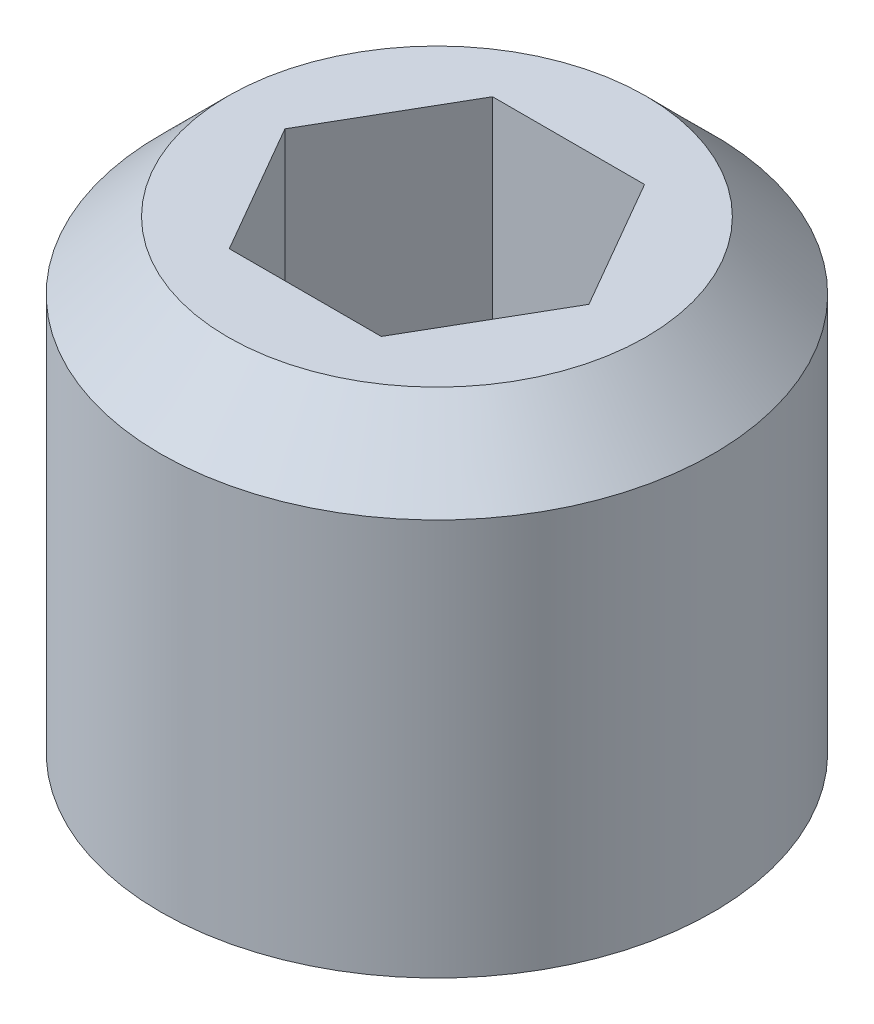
ISO-10303-21;
HEADER;
FILE_DESCRIPTION(('STEP AP214'),'2;1');
FILE_NAME('part.step','',(''),(''),'','','');
FILE_SCHEMA(('AUTOMOTIVE_DESIGN { 1 0 10303 214 1 1 1 1 }'));
ENDSEC;
DATA;
#1=APPLICATION_CONTEXT('core data for automotive mechanical design processes');
#2=APPLICATION_PROTOCOL_DEFINITION('international standard','automotive_design',2000,#1);
#3=PRODUCT_CONTEXT('',#1,'mechanical');
#4=PRODUCT('Part','Part','',(#3));
#5=PRODUCT_RELATED_PRODUCT_CATEGORY('part','',(#4));
#6=PRODUCT_DEFINITION_FORMATION('','',#4);
#7=PRODUCT_DEFINITION_CONTEXT('part definition',#1,'design');
#8=PRODUCT_DEFINITION('design','',#6,#7);
#9=PRODUCT_DEFINITION_SHAPE('','',#8);
#10=(LENGTH_UNIT() NAMED_UNIT(*) SI_UNIT(.MILLI.,.METRE.));
#11=(NAMED_UNIT(*) PLANE_ANGLE_UNIT() SI_UNIT($,.RADIAN.));
#12=(NAMED_UNIT(*) SI_UNIT($,.STERADIAN.) SOLID_ANGLE_UNIT());
#13=UNCERTAINTY_MEASURE_WITH_UNIT(LENGTH_MEASURE(1.E-05),#10,'distance_accuracy_value','');
#14=(GEOMETRIC_REPRESENTATION_CONTEXT(3) GLOBAL_UNCERTAINTY_ASSIGNED_CONTEXT((#13)) GLOBAL_UNIT_ASSIGNED_CONTEXT((#10,
#11,#12)) REPRESENTATION_CONTEXT('',''));
#15=CARTESIAN_POINT('',(0.,0.,0.));
#16=DIRECTION('',(0.,0.,1.));
#17=DIRECTION('',(1.,0.,0.));
#18=AXIS2_PLACEMENT_3D('',#15,#16,#17);
#19=CARTESIAN_POINT('',(0.,0.,0.));
#20=DIRECTION('',(0.,-1.,0.));
#21=DIRECTION('',(0.,0.,-1.));
#22=AXIS2_PLACEMENT_3D('',#19,#20,#21);
#23=PLANE('',#22);
#24=DIRECTION('',(-0.5,0.,-0.866025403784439));
#25=VECTOR('',#24,1.);
#26=CARTESIAN_POINT('',(1.14567944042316,0.,0.));
#27=LINE('',#26,#25);
#28=CARTESIAN_POINT('',(1.14567944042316,0.,0.));
#29=VERTEX_POINT('',#28);
#30=CARTESIAN_POINT('',(0.572839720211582,0.,-0.9921875));
#31=VERTEX_POINT('',#30);
#32=EDGE_CURVE('E98',#29,#31,#27,.T.);
#33=ORIENTED_EDGE('',*,*,#32,.F.);
#34=DIRECTION('',(0.5,0.,-0.866025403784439));
#35=VECTOR('',#34,1.);
#36=CARTESIAN_POINT('',(0.572839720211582,0.,0.9921875));
#37=LINE('',#36,#35);
#38=CARTESIAN_POINT('',(0.572839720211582,0.,0.9921875));
#39=VERTEX_POINT('',#38);
#40=EDGE_CURVE('E45',#39,#29,#37,.T.);
#41=ORIENTED_EDGE('',*,*,#40,.F.);
#42=DIRECTION('',(1.,0.,0.));
#43=VECTOR('',#42,1.);
#44=CARTESIAN_POINT('',(-0.572839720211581,0.,0.9921875));
#45=LINE('',#44,#43);
#46=CARTESIAN_POINT('',(-0.572839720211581,0.,0.9921875));
#47=VERTEX_POINT('',#46);
#48=EDGE_CURVE('E113',#47,#39,#45,.T.);
#49=ORIENTED_EDGE('',*,*,#48,.F.);
#50=DIRECTION('',(0.5,0.,0.866025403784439));
#51=VECTOR('',#50,1.);
#52=CARTESIAN_POINT('',(-1.14567944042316,0.,0.));
#53=LINE('',#52,#51);
#54=CARTESIAN_POINT('',(-1.14567944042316,0.,0.));
#55=VERTEX_POINT('',#54);
#56=EDGE_CURVE('E107',#55,#47,#53,.T.);
#57=ORIENTED_EDGE('',*,*,#56,.F.);
#58=DIRECTION('',(-0.5,0.,0.866025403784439));
#59=VECTOR('',#58,1.);
#60=CARTESIAN_POINT('',(-0.572839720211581,0.,-0.9921875));
#61=LINE('',#60,#59);
#62=CARTESIAN_POINT('',(-0.572839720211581,0.,-0.9921875));
#63=VERTEX_POINT('',#62);
#64=EDGE_CURVE('E105',#63,#55,#61,.T.);
#65=ORIENTED_EDGE('',*,*,#64,.F.);
#66=DIRECTION('',(-1.,0.,0.));
#67=VECTOR('',#66,1.);
#68=CARTESIAN_POINT('',(0.572839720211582,0.,-0.9921875));
#69=LINE('',#68,#67);
#70=EDGE_CURVE('E87',#31,#63,#69,.T.);
#71=ORIENTED_EDGE('',*,*,#70,.F.);
#72=EDGE_LOOP('',(#33,#41,#49,#57,#65,#71));
#73=FACE_BOUND('',#72,.T.);
#74=CARTESIAN_POINT('',(0.,0.,0.));
#75=DIRECTION('',(0.,1.,0.));
#76=DIRECTION('',(0.,0.,1.));
#77=AXIS2_PLACEMENT_3D('',#74,#75,#76);
#78=CIRCLE('',#77,1.5748);
#79=CARTESIAN_POINT('',(0.,0.,1.5748));
#80=VERTEX_POINT('',#79);
#81=EDGE_CURVE('E11',#80,#80,#78,.T.);
#82=ORIENTED_EDGE('',*,*,#81,.T.);
#83=EDGE_LOOP('',(#82));
#84=FACE_BOUND('',#83,.T.);
#85=ADVANCED_FACE('F31',(#73,#84),#23,.F.);
#86=CARTESIAN_POINT('',(0.,-0.507999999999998,0.));
#87=DIRECTION('',(0.,-1.,0.));
#88=DIRECTION('',(0.,0.,-1.));
#89=AXIS2_PLACEMENT_3D('',#86,#87,#88);
#90=CONICAL_SURFACE('',#89,2.0828,0.78539816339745);
#91=ORIENTED_EDGE('',*,*,#81,.F.);
#92=EDGE_LOOP('',(#91));
#93=FACE_BOUND('',#92,.T.);
#94=CARTESIAN_POINT('',(0.,-0.507999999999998,0.));
#95=DIRECTION('',(0.,1.,0.));
#96=DIRECTION('',(0.,0.,1.));
#97=AXIS2_PLACEMENT_3D('',#94,#95,#96);
#98=CIRCLE('',#97,2.0828);
#99=CARTESIAN_POINT('',(0.,-0.507999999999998,2.0828));
#100=VERTEX_POINT('',#99);
#101=EDGE_CURVE('E38',#100,#100,#98,.T.);
#102=ORIENTED_EDGE('',*,*,#101,.T.);
#103=EDGE_LOOP('',(#102));
#104=FACE_BOUND('',#103,.T.);
#105=ADVANCED_FACE('F144',(#93,#104),#90,.T.);
#106=CARTESIAN_POINT('',(0.,12.1646077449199,0.));
#107=DIRECTION('',(0.,1.,0.));
#108=DIRECTION('',(0.,0.,1.));
#109=AXIS2_PLACEMENT_3D('',#106,#107,#108);
#110=CYLINDRICAL_SURFACE('',#109,2.0828);
#111=ORIENTED_EDGE('',*,*,#101,.F.);
#112=EDGE_LOOP('',(#111));
#113=FACE_BOUND('',#112,.T.);
#114=CARTESIAN_POINT('',(0.,-3.49832750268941,0.));
#115=DIRECTION('',(0.,1.,0.));
#116=DIRECTION('',(0.,0.,1.));
#117=AXIS2_PLACEMENT_3D('',#114,#115,#116);
#118=CIRCLE('',#117,2.0828);
#119=CARTESIAN_POINT('',(0.,-3.49832750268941,2.0828));
#120=VERTEX_POINT('',#119);
#121=EDGE_CURVE('E133',#120,#120,#118,.T.);
#122=ORIENTED_EDGE('',*,*,#121,.T.);
#123=EDGE_LOOP('',(#122));
#124=FACE_BOUND('',#123,.T.);
#125=ADVANCED_FACE('F146',(#113,#124),#110,.T.);
#126=CARTESIAN_POINT('',(0.,-4.7498,0.));
#127=DIRECTION('',(0.,1.,0.));
#128=DIRECTION('',(0.,0.,1.));
#129=AXIS2_PLACEMENT_3D('',#126,#127,#128);
#130=CONICAL_SURFACE('',#129,0.,1.02974425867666);
#131=ORIENTED_EDGE('',*,*,#121,.F.);
#132=EDGE_LOOP('',(#131));
#133=FACE_BOUND('',#132,.T.);
#134=CARTESIAN_POINT('',(0.,-4.7498,0.));
#135=VERTEX_POINT('',#134);
#136=VERTEX_LOOP('',#135);
#137=FACE_BOUND('',#136,.T.);
#138=ADVANCED_FACE('F149',(#133,#137),#130,.T.);
#139=CARTESIAN_POINT('',(0.572839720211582,-2.286,0.9921875));
#140=DIRECTION('',(0.866025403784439,0.,0.5));
#141=DIRECTION('',(0.5,0.,-0.866025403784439));
#142=AXIS2_PLACEMENT_3D('',#139,#140,#141);
#143=PLANE('',#142);
#144=ORIENTED_EDGE('',*,*,#40,.T.);
#145=DIRECTION('',(0.,1.,0.));
#146=VECTOR('',#145,1.);
#147=CARTESIAN_POINT('',(1.14567944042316,-2.286,0.));
#148=LINE('',#147,#146);
#149=CARTESIAN_POINT('',(1.14567944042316,-2.286,0.));
#150=VERTEX_POINT('',#149);
#151=EDGE_CURVE('E95',#150,#29,#148,.T.);
#152=ORIENTED_EDGE('',*,*,#151,.F.);
#153=DIRECTION('',(0.5,0.,-0.866025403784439));
#154=VECTOR('',#153,1.);
#155=CARTESIAN_POINT('',(0.572839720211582,-2.286,0.9921875));
#156=LINE('',#155,#154);
#157=CARTESIAN_POINT('',(0.572839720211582,-2.286,0.9921875));
#158=VERTEX_POINT('',#157);
#159=EDGE_CURVE('E116',#158,#150,#156,.T.);
#160=ORIENTED_EDGE('',*,*,#159,.F.);
#161=DIRECTION('',(0.,1.,0.));
#162=VECTOR('',#161,1.);
#163=CARTESIAN_POINT('',(0.572839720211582,-2.286,0.9921875));
#164=LINE('',#163,#162);
#165=EDGE_CURVE('E131',#158,#39,#164,.T.);
#166=ORIENTED_EDGE('',*,*,#165,.T.);
#167=EDGE_LOOP('',(#144,#152,#160,#166));
#168=FACE_BOUND('',#167,.T.);
#169=ADVANCED_FACE('F154',(#168),#143,.F.);
#170=CARTESIAN_POINT('',(-0.572839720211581,-2.286,0.9921875));
#171=DIRECTION('',(0.,0.,1.));
#172=DIRECTION('',(1.,0.,0.));
#173=AXIS2_PLACEMENT_3D('',#170,#171,#172);
#174=PLANE('',#173);
#175=ORIENTED_EDGE('',*,*,#48,.T.);
#176=ORIENTED_EDGE('',*,*,#165,.F.);
#177=DIRECTION('',(1.,0.,0.));
#178=VECTOR('',#177,1.);
#179=CARTESIAN_POINT('',(-0.572839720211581,-2.286,0.9921875));
#180=LINE('',#179,#178);
#181=CARTESIAN_POINT('',(-0.572839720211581,-2.286,0.9921875));
#182=VERTEX_POINT('',#181);
#183=EDGE_CURVE('E128',#182,#158,#180,.T.);
#184=ORIENTED_EDGE('',*,*,#183,.F.);
#185=DIRECTION('',(0.,1.,0.));
#186=VECTOR('',#185,1.);
#187=CARTESIAN_POINT('',(-0.572839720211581,-2.286,0.9921875));
#188=LINE('',#187,#186);
#189=EDGE_CURVE('E134',#182,#47,#188,.T.);
#190=ORIENTED_EDGE('',*,*,#189,.T.);
#191=EDGE_LOOP('',(#175,#176,#184,#190));
#192=FACE_BOUND('',#191,.T.);
#193=ADVANCED_FACE('F159',(#192),#174,.F.);
#194=CARTESIAN_POINT('',(-1.14567944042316,-2.286,0.));
#195=DIRECTION('',(-0.866025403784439,0.,0.5));
#196=DIRECTION('',(0.5,0.,0.866025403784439));
#197=AXIS2_PLACEMENT_3D('',#194,#195,#196);
#198=PLANE('',#197);
#199=ORIENTED_EDGE('',*,*,#56,.T.);
#200=ORIENTED_EDGE('',*,*,#189,.F.);
#201=DIRECTION('',(0.5,0.,0.866025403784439));
#202=VECTOR('',#201,1.);
#203=CARTESIAN_POINT('',(-1.14567944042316,-2.286,0.));
#204=LINE('',#203,#202);
#205=CARTESIAN_POINT('',(-1.14567944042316,-2.286,0.));
#206=VERTEX_POINT('',#205);
#207=EDGE_CURVE('E125',#206,#182,#204,.T.);
#208=ORIENTED_EDGE('',*,*,#207,.F.);
#209=DIRECTION('',(0.,1.,0.));
#210=VECTOR('',#209,1.);
#211=CARTESIAN_POINT('',(-1.14567944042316,-2.286,0.));
#212=LINE('',#211,#210);
#213=EDGE_CURVE('E136',#206,#55,#212,.T.);
#214=ORIENTED_EDGE('',*,*,#213,.T.);
#215=EDGE_LOOP('',(#199,#200,#208,#214));
#216=FACE_BOUND('',#215,.T.);
#217=ADVANCED_FACE('F196',(#216),#198,.F.);
#218=CARTESIAN_POINT('',(-0.572839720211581,-2.286,-0.9921875));
#219=DIRECTION('',(-0.866025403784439,0.,-0.5));
#220=DIRECTION('',(-0.5,0.,0.866025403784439));
#221=AXIS2_PLACEMENT_3D('',#218,#219,#220);
#222=PLANE('',#221);
#223=ORIENTED_EDGE('',*,*,#64,.T.);
#224=ORIENTED_EDGE('',*,*,#213,.F.);
#225=DIRECTION('',(-0.5,0.,0.866025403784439));
#226=VECTOR('',#225,1.);
#227=CARTESIAN_POINT('',(-0.572839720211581,-2.286,-0.9921875));
#228=LINE('',#227,#226);
#229=CARTESIAN_POINT('',(-0.572839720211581,-2.286,-0.9921875));
#230=VERTEX_POINT('',#229);
#231=EDGE_CURVE('E122',#230,#206,#228,.T.);
#232=ORIENTED_EDGE('',*,*,#231,.F.);
#233=DIRECTION('',(0.,1.,0.));
#234=VECTOR('',#233,1.);
#235=CARTESIAN_POINT('',(-0.572839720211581,-2.286,-0.9921875));
#236=LINE('',#235,#234);
#237=EDGE_CURVE('E94',#230,#63,#236,.T.);
#238=ORIENTED_EDGE('',*,*,#237,.T.);
#239=EDGE_LOOP('',(#223,#224,#232,#238));
#240=FACE_BOUND('',#239,.T.);
#241=ADVANCED_FACE('F206',(#240),#222,.F.);
#242=CARTESIAN_POINT('',(0.572839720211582,-2.286,-0.9921875));
#243=DIRECTION('',(0.,0.,-1.));
#244=DIRECTION('',(-1.,0.,0.));
#245=AXIS2_PLACEMENT_3D('',#242,#243,#244);
#246=PLANE('',#245);
#247=ORIENTED_EDGE('',*,*,#70,.T.);
#248=ORIENTED_EDGE('',*,*,#237,.F.);
#249=DIRECTION('',(-1.,0.,0.));
#250=VECTOR('',#249,1.);
#251=CARTESIAN_POINT('',(0.572839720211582,-2.286,-0.9921875));
#252=LINE('',#251,#250);
#253=CARTESIAN_POINT('',(0.572839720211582,-2.286,-0.9921875));
#254=VERTEX_POINT('',#253);
#255=EDGE_CURVE('E90',#254,#230,#252,.T.);
#256=ORIENTED_EDGE('',*,*,#255,.F.);
#257=DIRECTION('',(0.,1.,0.));
#258=VECTOR('',#257,1.);
#259=CARTESIAN_POINT('',(0.572839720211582,-2.286,-0.9921875));
#260=LINE('',#259,#258);
#261=EDGE_CURVE('E83',#254,#31,#260,.T.);
#262=ORIENTED_EDGE('',*,*,#261,.T.);
#263=EDGE_LOOP('',(#247,#248,#256,#262));
#264=FACE_BOUND('',#263,.T.);
#265=ADVANCED_FACE('F85',(#264),#246,.F.);
#266=CARTESIAN_POINT('',(1.14567944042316,-2.286,0.));
#267=DIRECTION('',(0.866025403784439,0.,-0.5));
#268=DIRECTION('',(-0.5,0.,-0.866025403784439));
#269=AXIS2_PLACEMENT_3D('',#266,#267,#268);
#270=PLANE('',#269);
#271=ORIENTED_EDGE('',*,*,#32,.T.);
#272=ORIENTED_EDGE('',*,*,#261,.F.);
#273=DIRECTION('',(-0.5,0.,-0.866025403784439));
#274=VECTOR('',#273,1.);
#275=CARTESIAN_POINT('',(1.14567944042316,-2.286,0.));
#276=LINE('',#275,#274);
#277=EDGE_CURVE('E119',#150,#254,#276,.T.);
#278=ORIENTED_EDGE('',*,*,#277,.F.);
#279=ORIENTED_EDGE('',*,*,#151,.T.);
#280=EDGE_LOOP('',(#271,#272,#278,#279));
#281=FACE_BOUND('',#280,.T.);
#282=ADVANCED_FACE('F99',(#281),#270,.F.);
#283=CARTESIAN_POINT('',(1.71851916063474,-2.286,-0.9921875));
#284=DIRECTION('',(0.,1.,0.));
#285=DIRECTION('',(0.,0.,1.));
#286=AXIS2_PLACEMENT_3D('',#283,#284,#285);
#287=PLANE('',#286);
#288=ORIENTED_EDGE('',*,*,#159,.T.);
#289=ORIENTED_EDGE('',*,*,#277,.T.);
#290=ORIENTED_EDGE('',*,*,#255,.T.);
#291=ORIENTED_EDGE('',*,*,#231,.T.);
#292=ORIENTED_EDGE('',*,*,#207,.T.);
#293=ORIENTED_EDGE('',*,*,#183,.T.);
#294=EDGE_LOOP('',(#288,#289,#290,#291,#292,#293));
#295=FACE_BOUND('',#294,.T.);
#296=ADVANCED_FACE('F233',(#295),#287,.T.);
#297=CLOSED_SHELL('',(#85,#105,#125,#138,#169,#193,#217,#241,#265,#282,#296));
#298=MANIFOLD_SOLID_BREP('B2',#297);
#299=ADVANCED_BREP_SHAPE_REPRESENTATION('',(#18,#298),#14);
#300=SHAPE_DEFINITION_REPRESENTATION(#9,#299);
ENDSEC;
END-ISO-10303-21;
